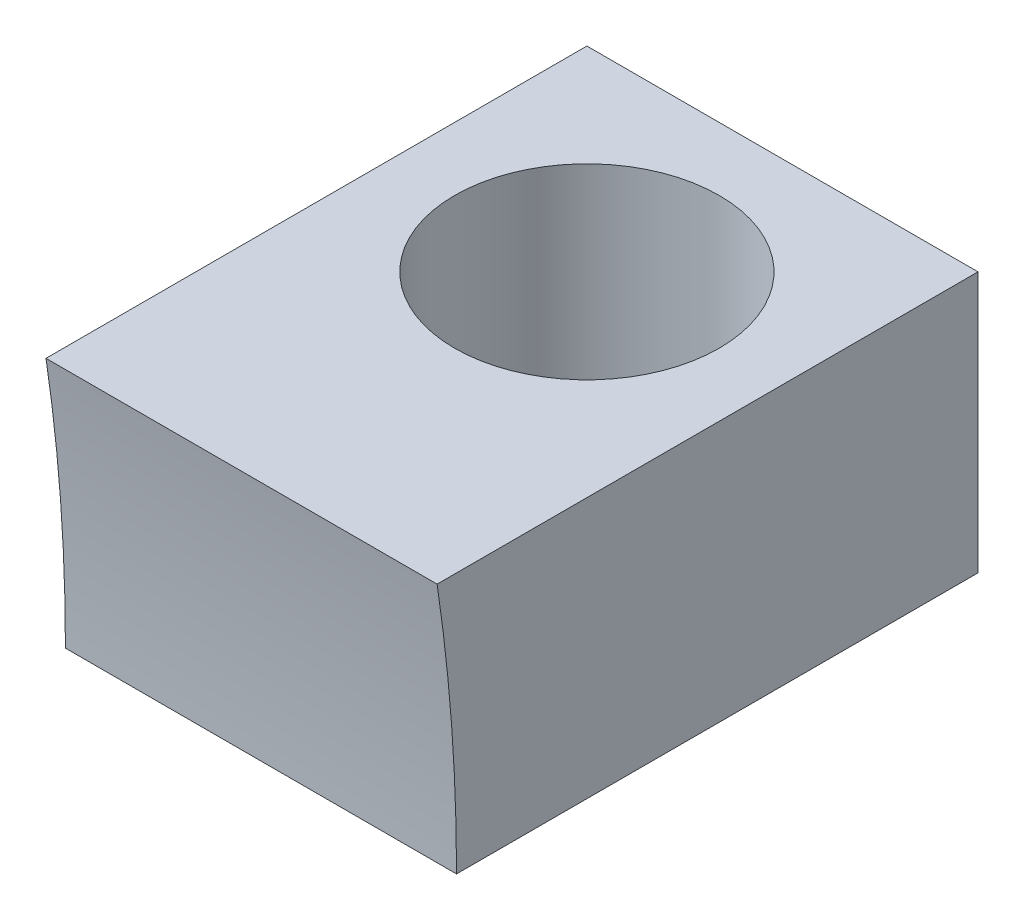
from build123d import *

# Parameters (mm, degrees)
BOSS_EXTRUDE1_DEPTH = 3.81
SKETCH2_R           = 2.5781
CUT_EXTRUDE1_DEPTH  = 9.373556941


with BuildPart() as part:
    # Sketch1 → Boss-Extrude1 (new, symmetric)
    with BuildSketch(Plane(origin=(0, 0, 0), x_dir=(0, 0, -1), z_dir=(1, 0, 0))):
        with BuildLine():
            Line((-5.458383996, 2.54), (5.08, 2.54))
            Line((5.08, 2.54), (5.08, -2.54))
            Line((5.08, -2.54), (-5.08, -2.54))
            ThreePointArc((-5.08, -2.54), (-5.174726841, 0.007036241), (-5.458383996, 2.54))
        make_face()
    extrude(amount=BOSS_EXTRUDE1_DEPTH, both=True)

    # Sketch2 → Cut-Extrude1 (cut, through all)
    with BuildSketch(Plane.XZ.offset(2.54)):
        with Locations(Location((0, -1.27, 0), (0, 0, 270))):
            Circle(SKETCH2_R)
    extrude(amount=-CUT_EXTRUDE1_DEPTH, mode=Mode.SUBTRACT)


solid = part.part
